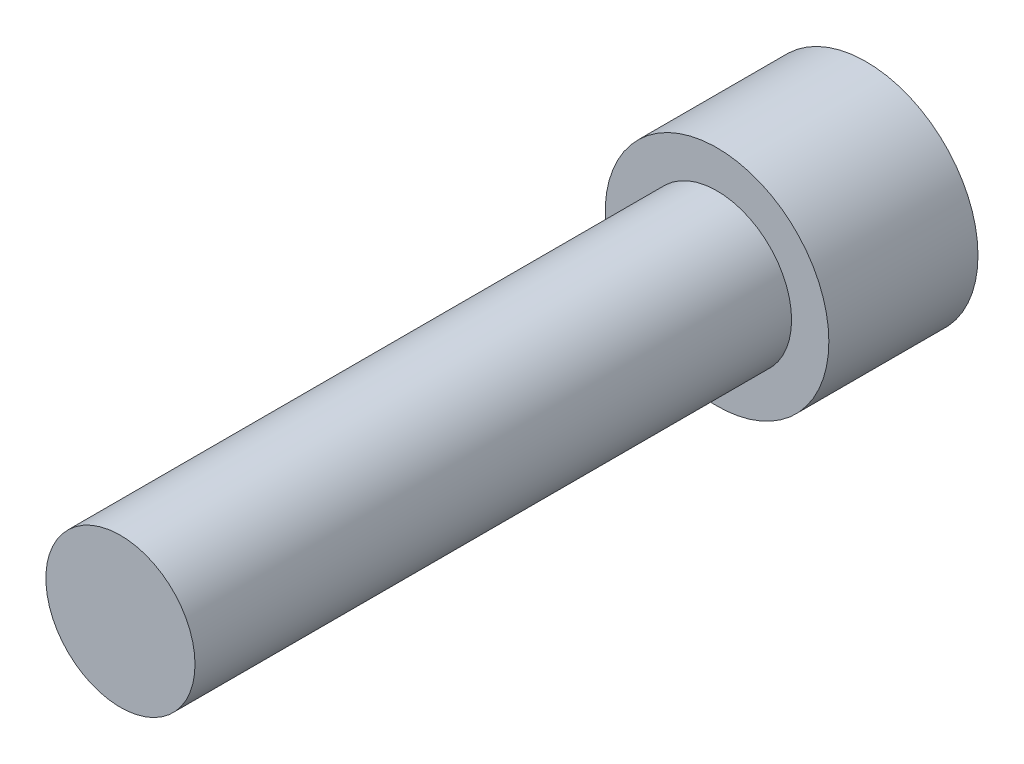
ISO-10303-21;
HEADER;
FILE_DESCRIPTION(('STEP AP214'),'2;1');
FILE_NAME('part.step','',(''),(''),'','','');
FILE_SCHEMA(('AUTOMOTIVE_DESIGN { 1 0 10303 214 1 1 1 1 }'));
ENDSEC;
DATA;
#1=APPLICATION_CONTEXT('core data for automotive mechanical design processes');
#2=APPLICATION_PROTOCOL_DEFINITION('international standard','automotive_design',2000,#1);
#3=PRODUCT_CONTEXT('',#1,'mechanical');
#4=PRODUCT('Part','Part','',(#3));
#5=PRODUCT_RELATED_PRODUCT_CATEGORY('part','',(#4));
#6=PRODUCT_DEFINITION_FORMATION('','',#4);
#7=PRODUCT_DEFINITION_CONTEXT('part definition',#1,'design');
#8=PRODUCT_DEFINITION('design','',#6,#7);
#9=PRODUCT_DEFINITION_SHAPE('','',#8);
#10=(LENGTH_UNIT() NAMED_UNIT(*) SI_UNIT(.MILLI.,.METRE.));
#11=(NAMED_UNIT(*) PLANE_ANGLE_UNIT() SI_UNIT($,.RADIAN.));
#12=(NAMED_UNIT(*) SI_UNIT($,.STERADIAN.) SOLID_ANGLE_UNIT());
#13=UNCERTAINTY_MEASURE_WITH_UNIT(LENGTH_MEASURE(1.E-05),#10,'distance_accuracy_value','');
#14=(GEOMETRIC_REPRESENTATION_CONTEXT(3) GLOBAL_UNCERTAINTY_ASSIGNED_CONTEXT((#13)) GLOBAL_UNIT_ASSIGNED_CONTEXT((#10,
#11,#12)) REPRESENTATION_CONTEXT('',''));
#15=CARTESIAN_POINT('',(0.,0.,0.));
#16=DIRECTION('',(0.,0.,1.));
#17=DIRECTION('',(1.,0.,0.));
#18=AXIS2_PLACEMENT_3D('',#15,#16,#17);
#19=CARTESIAN_POINT('',(0.,-4.7625,-6.35));
#20=DIRECTION('',(0.,0.,-1.));
#21=DIRECTION('',(-1.,0.,0.));
#22=AXIS2_PLACEMENT_3D('',#19,#20,#21);
#23=PLANE('',#22);
#24=DIRECTION('',(0.866025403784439,-0.5,0.));
#25=VECTOR('',#24,1.);
#26=CARTESIAN_POINT('',(0.,2.7569630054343,-6.35));
#27=LINE('',#26,#25);
#28=CARTESIAN_POINT('',(0.,2.7569630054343,-6.35));
#29=VERTEX_POINT('',#28);
#30=CARTESIAN_POINT('',(2.3876,1.37848150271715,-6.35));
#31=VERTEX_POINT('',#30);
#32=EDGE_CURVE('E51',#29,#31,#27,.T.);
#33=ORIENTED_EDGE('',*,*,#32,.F.);
#34=DIRECTION('',(0.866025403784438,0.5,0.));
#35=VECTOR('',#34,1.);
#36=CARTESIAN_POINT('',(-2.3876,1.37848150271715,-6.35));
#37=LINE('',#36,#35);
#38=CARTESIAN_POINT('',(-2.3876,1.37848150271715,-6.35));
#39=VERTEX_POINT('',#38);
#40=EDGE_CURVE('E134',#39,#29,#37,.T.);
#41=ORIENTED_EDGE('',*,*,#40,.F.);
#42=DIRECTION('',(0.,1.,0.));
#43=VECTOR('',#42,1.);
#44=CARTESIAN_POINT('',(-2.3876,-1.37848150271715,-6.35));
#45=LINE('',#44,#43);
#46=CARTESIAN_POINT('',(-2.3876,-1.37848150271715,-6.35));
#47=VERTEX_POINT('',#46);
#48=EDGE_CURVE('E132',#47,#39,#45,.T.);
#49=ORIENTED_EDGE('',*,*,#48,.F.);
#50=DIRECTION('',(-0.866025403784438,0.5,0.));
#51=VECTOR('',#50,1.);
#52=CARTESIAN_POINT('',(0.,-2.7569630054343,-6.35));
#53=LINE('',#52,#51);
#54=CARTESIAN_POINT('',(0.,-2.7569630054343,-6.35));
#55=VERTEX_POINT('',#54);
#56=EDGE_CURVE('E99',#55,#47,#53,.T.);
#57=ORIENTED_EDGE('',*,*,#56,.F.);
#58=DIRECTION('',(-0.866025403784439,-0.5,0.));
#59=VECTOR('',#58,1.);
#60=CARTESIAN_POINT('',(2.3876,-1.37848150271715,-6.35));
#61=LINE('',#60,#59);
#62=CARTESIAN_POINT('',(2.3876,-1.37848150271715,-6.35));
#63=VERTEX_POINT('',#62);
#64=EDGE_CURVE('E128',#63,#55,#61,.T.);
#65=ORIENTED_EDGE('',*,*,#64,.F.);
#66=DIRECTION('',(0.,-1.,0.));
#67=VECTOR('',#66,1.);
#68=CARTESIAN_POINT('',(2.3876,1.37848150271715,-6.35));
#69=LINE('',#68,#67);
#70=EDGE_CURVE('E125',#31,#63,#69,.T.);
#71=ORIENTED_EDGE('',*,*,#70,.F.);
#72=EDGE_LOOP('',(#33,#41,#49,#57,#65,#71));
#73=FACE_BOUND('',#72,.T.);
#74=CARTESIAN_POINT('',(0.,0.,-6.35));
#75=DIRECTION('',(0.,0.,1.));
#76=DIRECTION('',(1.,0.,0.));
#77=AXIS2_PLACEMENT_3D('',#74,#75,#76);
#78=CIRCLE('',#77,4.7625);
#79=CARTESIAN_POINT('',(4.7625,0.,-6.35));
#80=VERTEX_POINT('',#79);
#81=EDGE_CURVE('E11',#80,#80,#78,.T.);
#82=ORIENTED_EDGE('',*,*,#81,.F.);
#83=EDGE_LOOP('',(#82));
#84=FACE_BOUND('',#83,.T.);
#85=ADVANCED_FACE('F37',(#73,#84),#23,.T.);
#86=CARTESIAN_POINT('',(0.,0.,25.4));
#87=DIRECTION('',(0.,0.,1.));
#88=DIRECTION('',(1.,0.,0.));
#89=AXIS2_PLACEMENT_3D('',#86,#87,#88);
#90=CYLINDRICAL_SURFACE('',#89,4.7625);
#91=ORIENTED_EDGE('',*,*,#81,.T.);
#92=EDGE_LOOP('',(#91));
#93=FACE_BOUND('',#92,.T.);
#94=CARTESIAN_POINT('',(0.,0.,0.));
#95=DIRECTION('',(0.,0.,1.));
#96=DIRECTION('',(1.,0.,0.));
#97=AXIS2_PLACEMENT_3D('',#94,#95,#96);
#98=CIRCLE('',#97,4.7625);
#99=CARTESIAN_POINT('',(4.7625,0.,0.));
#100=VERTEX_POINT('',#99);
#101=EDGE_CURVE('E44',#100,#100,#98,.T.);
#102=ORIENTED_EDGE('',*,*,#101,.F.);
#103=EDGE_LOOP('',(#102));
#104=FACE_BOUND('',#103,.T.);
#105=ADVANCED_FACE('F154',(#93,#104),#90,.T.);
#106=CARTESIAN_POINT('',(0.,-3.175,0.));
#107=DIRECTION('',(0.,0.,1.));
#108=DIRECTION('',(1.,0.,0.));
#109=AXIS2_PLACEMENT_3D('',#106,#107,#108);
#110=PLANE('',#109);
#111=ORIENTED_EDGE('',*,*,#101,.T.);
#112=EDGE_LOOP('',(#111));
#113=FACE_BOUND('',#112,.T.);
#114=CARTESIAN_POINT('',(0.,0.,0.));
#115=DIRECTION('',(0.,0.,1.));
#116=DIRECTION('',(1.,0.,0.));
#117=AXIS2_PLACEMENT_3D('',#114,#115,#116);
#118=CIRCLE('',#117,3.175);
#119=CARTESIAN_POINT('',(3.175,0.,0.));
#120=VERTEX_POINT('',#119);
#121=EDGE_CURVE('E146',#120,#120,#118,.T.);
#122=ORIENTED_EDGE('',*,*,#121,.F.);
#123=EDGE_LOOP('',(#122));
#124=FACE_BOUND('',#123,.T.);
#125=ADVANCED_FACE('F151',(#113,#124),#110,.T.);
#126=CARTESIAN_POINT('',(0.,0.,25.4));
#127=DIRECTION('',(0.,0.,1.));
#128=DIRECTION('',(1.,0.,0.));
#129=AXIS2_PLACEMENT_3D('',#126,#127,#128);
#130=CYLINDRICAL_SURFACE('',#129,3.175);
#131=ORIENTED_EDGE('',*,*,#121,.T.);
#132=EDGE_LOOP('',(#131));
#133=FACE_BOUND('',#132,.T.);
#134=CARTESIAN_POINT('',(0.,0.,25.4));
#135=DIRECTION('',(0.,0.,1.));
#136=DIRECTION('',(1.,0.,0.));
#137=AXIS2_PLACEMENT_3D('',#134,#135,#136);
#138=CIRCLE('',#137,3.175);
#139=CARTESIAN_POINT('',(3.175,0.,25.4));
#140=VERTEX_POINT('',#139);
#141=EDGE_CURVE('E138',#140,#140,#138,.T.);
#142=ORIENTED_EDGE('',*,*,#141,.F.);
#143=EDGE_LOOP('',(#142));
#144=FACE_BOUND('',#143,.T.);
#145=ADVANCED_FACE('F161',(#133,#144),#130,.T.);
#146=CARTESIAN_POINT('',(0.,0.,25.4));
#147=DIRECTION('',(0.,0.,1.));
#148=DIRECTION('',(1.,0.,0.));
#149=AXIS2_PLACEMENT_3D('',#146,#147,#148);
#150=PLANE('',#149);
#151=ORIENTED_EDGE('',*,*,#141,.T.);
#152=EDGE_LOOP('',(#151));
#153=FACE_BOUND('',#152,.T.);
#154=ADVANCED_FACE('F167',(#153),#150,.T.);
#155=CARTESIAN_POINT('',(0.,2.7569630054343,-2.794));
#156=DIRECTION('',(0.5,0.866025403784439,0.));
#157=DIRECTION('',(-0.866025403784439,0.5,0.));
#158=AXIS2_PLACEMENT_3D('',#155,#156,#157);
#159=PLANE('',#158);
#160=ORIENTED_EDGE('',*,*,#32,.T.);
#161=DIRECTION('',(0.,0.,-1.));
#162=VECTOR('',#161,1.);
#163=CARTESIAN_POINT('',(2.3876,1.37848150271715,-2.794));
#164=LINE('',#163,#162);
#165=CARTESIAN_POINT('',(2.3876,1.37848150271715,-2.794));
#166=VERTEX_POINT('',#165);
#167=EDGE_CURVE('E81',#166,#31,#164,.T.);
#168=ORIENTED_EDGE('',*,*,#167,.F.);
#169=DIRECTION('',(0.866025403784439,-0.5,0.));
#170=VECTOR('',#169,1.);
#171=CARTESIAN_POINT('',(0.,2.7569630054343,-2.794));
#172=LINE('',#171,#170);
#173=CARTESIAN_POINT('',(0.,2.7569630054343,-2.794));
#174=VERTEX_POINT('',#173);
#175=EDGE_CURVE('E136',#174,#166,#172,.T.);
#176=ORIENTED_EDGE('',*,*,#175,.F.);
#177=DIRECTION('',(0.,0.,-1.));
#178=VECTOR('',#177,1.);
#179=CARTESIAN_POINT('',(0.,2.7569630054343,-2.794));
#180=LINE('',#179,#178);
#181=EDGE_CURVE('E59',#174,#29,#180,.T.);
#182=ORIENTED_EDGE('',*,*,#181,.T.);
#183=EDGE_LOOP('',(#160,#168,#176,#182));
#184=FACE_BOUND('',#183,.T.);
#185=ADVANCED_FACE('F171',(#184),#159,.F.);
#186=CARTESIAN_POINT('',(-2.3876,1.37848150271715,-2.794));
#187=DIRECTION('',(-0.5,0.866025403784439,0.));
#188=DIRECTION('',(-0.866025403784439,-0.5,0.));
#189=AXIS2_PLACEMENT_3D('',#186,#187,#188);
#190=PLANE('',#189);
#191=ORIENTED_EDGE('',*,*,#40,.T.);
#192=ORIENTED_EDGE('',*,*,#181,.F.);
#193=DIRECTION('',(0.866025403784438,0.5,0.));
#194=VECTOR('',#193,1.);
#195=CARTESIAN_POINT('',(-2.3876,1.37848150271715,-2.794));
#196=LINE('',#195,#194);
#197=CARTESIAN_POINT('',(-2.3876,1.37848150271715,-2.794));
#198=VERTEX_POINT('',#197);
#199=EDGE_CURVE('E111',#198,#174,#196,.T.);
#200=ORIENTED_EDGE('',*,*,#199,.F.);
#201=DIRECTION('',(0.,0.,-1.));
#202=VECTOR('',#201,1.);
#203=CARTESIAN_POINT('',(-2.3876,1.37848150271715,-2.794));
#204=LINE('',#203,#202);
#205=EDGE_CURVE('E103',#198,#39,#204,.T.);
#206=ORIENTED_EDGE('',*,*,#205,.T.);
#207=EDGE_LOOP('',(#191,#192,#200,#206));
#208=FACE_BOUND('',#207,.T.);
#209=ADVANCED_FACE('F175',(#208),#190,.F.);
#210=CARTESIAN_POINT('',(-2.3876,-1.37848150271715,-2.794));
#211=DIRECTION('',(-1.,0.,0.));
#212=DIRECTION('',(0.,0.,1.));
#213=AXIS2_PLACEMENT_3D('',#210,#211,#212);
#214=PLANE('',#213);
#215=ORIENTED_EDGE('',*,*,#48,.T.);
#216=ORIENTED_EDGE('',*,*,#205,.F.);
#217=DIRECTION('',(0.,1.,0.));
#218=VECTOR('',#217,1.);
#219=CARTESIAN_POINT('',(-2.3876,-1.37848150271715,-2.794));
#220=LINE('',#219,#218);
#221=CARTESIAN_POINT('',(-2.3876,-1.37848150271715,-2.794));
#222=VERTEX_POINT('',#221);
#223=EDGE_CURVE('E107',#222,#198,#220,.T.);
#224=ORIENTED_EDGE('',*,*,#223,.F.);
#225=DIRECTION('',(0.,0.,-1.));
#226=VECTOR('',#225,1.);
#227=CARTESIAN_POINT('',(-2.3876,-1.37848150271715,-2.794));
#228=LINE('',#227,#226);
#229=EDGE_CURVE('E92',#222,#47,#228,.T.);
#230=ORIENTED_EDGE('',*,*,#229,.T.);
#231=EDGE_LOOP('',(#215,#216,#224,#230));
#232=FACE_BOUND('',#231,.T.);
#233=ADVANCED_FACE('F108',(#232),#214,.F.);
#234=CARTESIAN_POINT('',(0.,-2.7569630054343,-2.794));
#235=DIRECTION('',(-0.5,-0.866025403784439,0.));
#236=DIRECTION('',(0.866025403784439,-0.5,0.));
#237=AXIS2_PLACEMENT_3D('',#234,#235,#236);
#238=PLANE('',#237);
#239=ORIENTED_EDGE('',*,*,#56,.T.);
#240=ORIENTED_EDGE('',*,*,#229,.F.);
#241=DIRECTION('',(-0.866025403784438,0.5,0.));
#242=VECTOR('',#241,1.);
#243=CARTESIAN_POINT('',(0.,-2.7569630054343,-2.794));
#244=LINE('',#243,#242);
#245=CARTESIAN_POINT('',(0.,-2.7569630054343,-2.794));
#246=VERTEX_POINT('',#245);
#247=EDGE_CURVE('E96',#246,#222,#244,.T.);
#248=ORIENTED_EDGE('',*,*,#247,.F.);
#249=DIRECTION('',(0.,0.,-1.));
#250=VECTOR('',#249,1.);
#251=CARTESIAN_POINT('',(0.,-2.7569630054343,-2.794));
#252=LINE('',#251,#250);
#253=EDGE_CURVE('E104',#246,#55,#252,.T.);
#254=ORIENTED_EDGE('',*,*,#253,.T.);
#255=EDGE_LOOP('',(#239,#240,#248,#254));
#256=FACE_BOUND('',#255,.T.);
#257=ADVANCED_FACE('F94',(#256),#238,.F.);
#258=CARTESIAN_POINT('',(2.3876,-1.37848150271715,-2.794));
#259=DIRECTION('',(0.5,-0.866025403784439,0.));
#260=DIRECTION('',(0.866025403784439,0.5,0.));
#261=AXIS2_PLACEMENT_3D('',#258,#259,#260);
#262=PLANE('',#261);
#263=ORIENTED_EDGE('',*,*,#64,.T.);
#264=ORIENTED_EDGE('',*,*,#253,.F.);
#265=DIRECTION('',(-0.866025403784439,-0.5,0.));
#266=VECTOR('',#265,1.);
#267=CARTESIAN_POINT('',(2.3876,-1.37848150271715,-2.794));
#268=LINE('',#267,#266);
#269=CARTESIAN_POINT('',(2.3876,-1.37848150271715,-2.794));
#270=VERTEX_POINT('',#269);
#271=EDGE_CURVE('E117',#270,#246,#268,.T.);
#272=ORIENTED_EDGE('',*,*,#271,.F.);
#273=DIRECTION('',(0.,0.,-1.));
#274=VECTOR('',#273,1.);
#275=CARTESIAN_POINT('',(2.3876,-1.37848150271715,-2.794));
#276=LINE('',#275,#274);
#277=EDGE_CURVE('E141',#270,#63,#276,.T.);
#278=ORIENTED_EDGE('',*,*,#277,.T.);
#279=EDGE_LOOP('',(#263,#264,#272,#278));
#280=FACE_BOUND('',#279,.T.);
#281=ADVANCED_FACE('F179',(#280),#262,.F.);
#282=CARTESIAN_POINT('',(2.3876,1.37848150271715,-2.794));
#283=DIRECTION('',(1.,0.,0.));
#284=DIRECTION('',(0.,0.,-1.));
#285=AXIS2_PLACEMENT_3D('',#282,#283,#284);
#286=PLANE('',#285);
#287=ORIENTED_EDGE('',*,*,#70,.T.);
#288=ORIENTED_EDGE('',*,*,#277,.F.);
#289=DIRECTION('',(0.,-1.,0.));
#290=VECTOR('',#289,1.);
#291=CARTESIAN_POINT('',(2.3876,1.37848150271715,-2.794));
#292=LINE('',#291,#290);
#293=EDGE_CURVE('E119',#166,#270,#292,.T.);
#294=ORIENTED_EDGE('',*,*,#293,.F.);
#295=ORIENTED_EDGE('',*,*,#167,.T.);
#296=EDGE_LOOP('',(#287,#288,#294,#295));
#297=FACE_BOUND('',#296,.T.);
#298=ADVANCED_FACE('F176',(#297),#286,.F.);
#299=CARTESIAN_POINT('',(0.,2.7569630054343,-2.794));
#300=DIRECTION('',(0.,0.,1.));
#301=DIRECTION('',(1.,0.,0.));
#302=AXIS2_PLACEMENT_3D('',#299,#300,#301);
#303=PLANE('',#302);
#304=ORIENTED_EDGE('',*,*,#175,.T.);
#305=ORIENTED_EDGE('',*,*,#293,.T.);
#306=ORIENTED_EDGE('',*,*,#271,.T.);
#307=ORIENTED_EDGE('',*,*,#247,.T.);
#308=ORIENTED_EDGE('',*,*,#223,.T.);
#309=ORIENTED_EDGE('',*,*,#199,.T.);
#310=EDGE_LOOP('',(#304,#305,#306,#307,#308,#309));
#311=FACE_BOUND('',#310,.T.);
#312=ADVANCED_FACE('F114',(#311),#303,.F.);
#313=CLOSED_SHELL('',(#85,#105,#125,#145,#154,#185,#209,#233,#257,#281,#298,#312));
#314=MANIFOLD_SOLID_BREP('B2',#313);
#315=ADVANCED_BREP_SHAPE_REPRESENTATION('',(#18,#314),#14);
#316=SHAPE_DEFINITION_REPRESENTATION(#9,#315);
ENDSEC;
END-ISO-10303-21;
